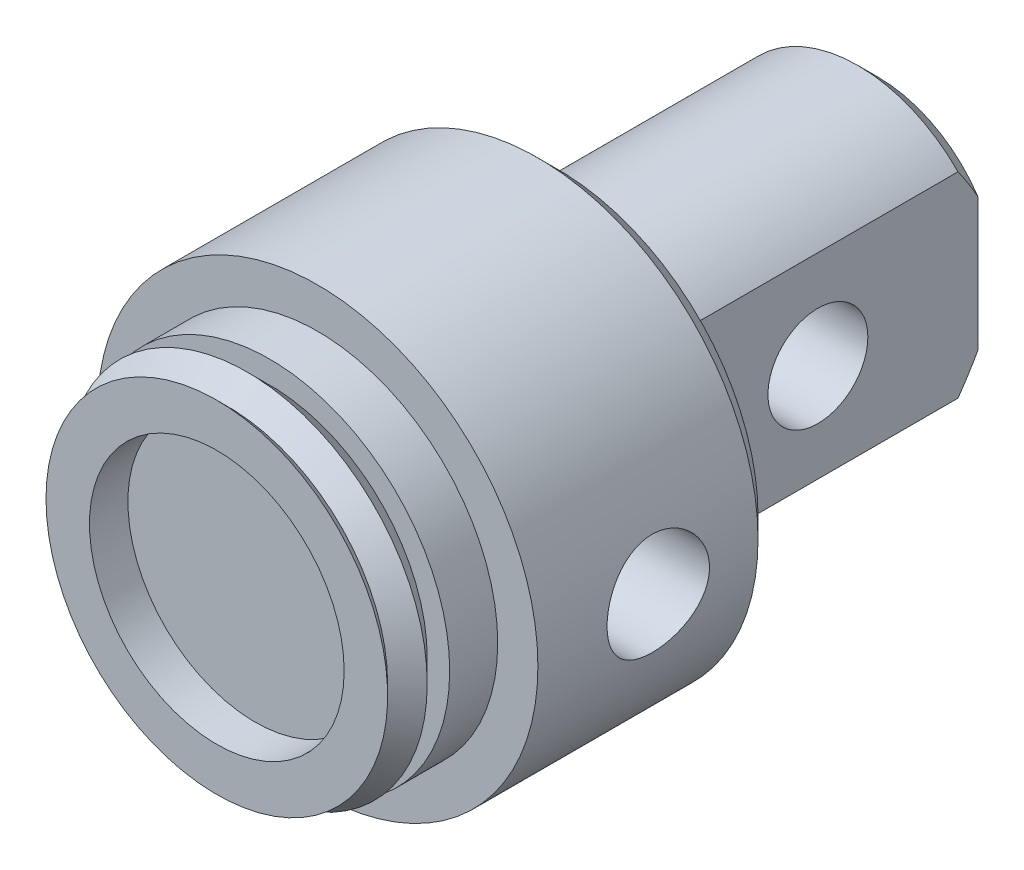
from build123d import *

# Parameters (mm, degrees)
SKETCH4_R              = 8.7376
BODY_DEPTH             = 9.525
SKETCH5_R              = 5.55625
BODY_2_DEPTH           = 12.7
BODY_CHAMFER_SIZE      = 0.79375
SKETCH6_W              = 2.54
SKETCH6_H              = 12.7
BODY_2_FLATS_CUT_DEPTH = 11.8872
SKETCH7_R              = 1.9812
BODY_2_HOLE_CUT_DEPTH  = 31.421274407
SKETCH8_R              = 2.032
CUT_EXTRUDE_B1_DEPTH   = 29.988760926
SKETCH14_R             = 5.050924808
CUT_EXTRUDE1_DEPTH     = 1.524


with BuildPart() as part:
    # Sketch1 → Base (revolve)
    with BuildSketch(Plane(origin=(0, 0, 0), x_dir=(0, 0, -1), z_dir=(1, 0, 0)), mode=Mode.PRIVATE) as base_sk:
        Polygon((0, 0), (0, 6.77545), (0.41656, 6.35889), (1.20142, 7.14375), (2.093214, 6.251956), (2.093214, 7.14375), (3.998214, 7.14375), (3.998214, 0), align=None)
    revolve(base_sk.sketch.rotate(Axis((0, 0, -71.294124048), (0, 0, 1)), 90), axis=Axis((0, 0, -71.294124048), (0, 0, 1)))

    # Sketch4 → Body (add)
    with BuildSketch(Plane(origin=(0, 0, -3.998214), x_dir=(-1, 0, 0), z_dir=(0, 0, -1))):
        with Locations(Location((0, 0, 0), (0, 0, 180))):
            Circle(SKETCH4_R)
    extrude(amount=BODY_DEPTH)

    # Sketch5 → Body 2 (add)
    with BuildSketch(Plane(origin=(0, 0, -13.523214), x_dir=(-1, 0, 0), z_dir=(0, 0, -1))):
        Circle(SKETCH5_R)
    extrude(amount=BODY_2_DEPTH)

    # Body Chamfer
    body_chamfer_edges = [part.edges().sort_by_distance(p)[0] for p in [
        (-8.7376, 0, -13.523214),
        (5.55625, 0, -26.223214),
    ]]
    chamfer(body_chamfer_edges, length=BODY_CHAMFER_SIZE)

    # Sketch6 → Body 2 Flats Cut (cut)
    with BuildSketch(Plane(origin=(0, 0, -26.223214), x_dir=(-1, 0, 0), z_dir=(0, 0, -1))):
        with Locations((-5.23875, 0)):
            Rectangle(SKETCH6_W, SKETCH6_H)
        with Locations((5.23875, 0)):
            Rectangle(SKETCH6_W, SKETCH6_H)
    extrude(amount=-BODY_2_FLATS_CUT_DEPTH, mode=Mode.SUBTRACT)

    # Sketch7 → Body 2 Hole Cut (cut, through all)
    with BuildSketch(Plane(origin=(3.96875, 0, 0), x_dir=(0, 0, -1), z_dir=(1, 0, 0))):
        with Locations((19.873214, 0)):
            Circle(SKETCH7_R)
    extrude(amount=-BODY_2_HOLE_CUT_DEPTH, mode=Mode.SUBTRACT)

    # Sketch8 → Cut-Extrude B1 (cut, through all)
    with BuildSketch(Plane(origin=(0, 0, 0), x_dir=(0, 0, -1), z_dir=(1, 0, 0))):
        with Locations((8.773414, 0)):
            Circle(SKETCH8_R)
    extrude(amount=CUT_EXTRUDE_B1_DEPTH, mode=Mode.SUBTRACT)

    # Sketch14 → Cut-Extrude1 (cut)
    with BuildSketch(Plane.XY):
        Circle(SKETCH14_R)
    extrude(amount=-CUT_EXTRUDE1_DEPTH, mode=Mode.SUBTRACT)


solid = part.part
